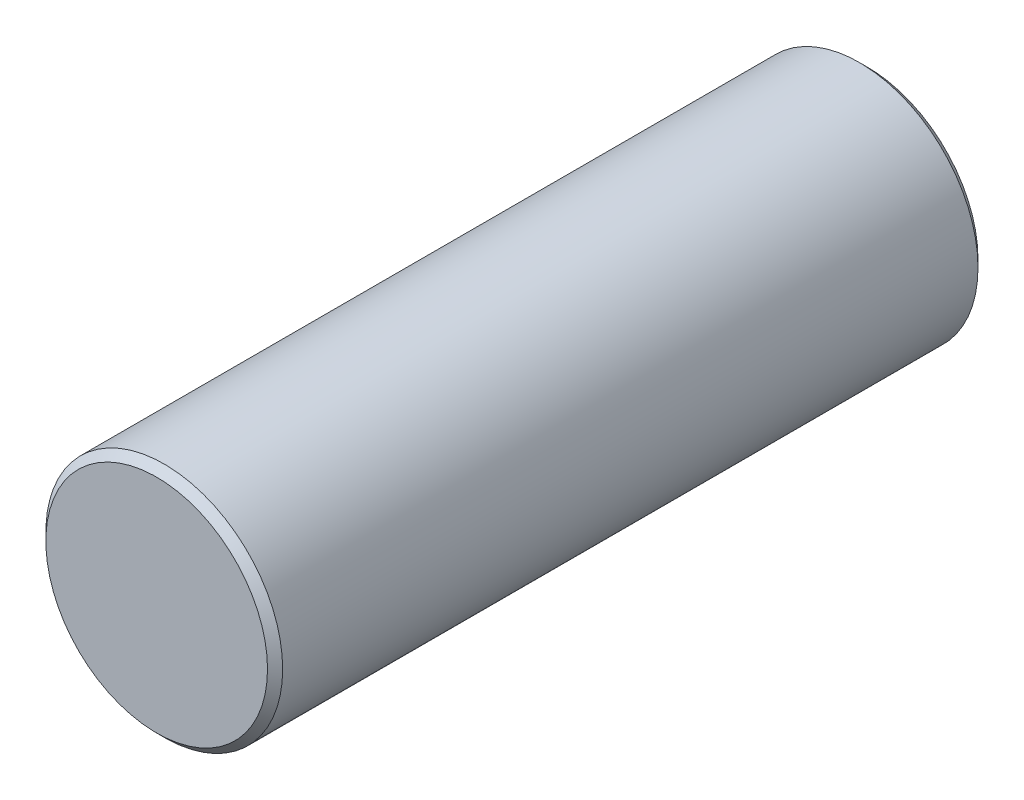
from build123d import *

# Parameters (mm, degrees)
SKETCH1_R         = 6.35
EXTRUDE1_DEPTH    = 19.05
CHAMFER1_SIZE     = 0.4064
SKETCH6_R         = 1.984375
BLIND_HOLES_DEPTH = 6.35


with BuildPart() as part:
    # Sketch1 → Extrude1 (new, symmetric)
    with BuildSketch(Plane.XY):
        with Locations(Location((0, 0, 0), (0, 0, 180))):
            Circle(SKETCH1_R)
    extrude(amount=EXTRUDE1_DEPTH, both=True)

    # Chamfer1
    chamfer1_edges = [part.edges().sort_by_distance(p)[0] for p in [
        (6.35, 0, -19.05),
        (6.35, 0, 19.05),
    ]]
    chamfer(chamfer1_edges, length=CHAMFER1_SIZE)

    # Sketch6 → Blind Holes (cut)
    with BuildSketch(Plane(origin=(0, -6.35, 0), x_dir=(-1, 0, 0), z_dir=(0, 1, 0))):
        with Locations(Location((0, 12.7, 0), (0, 0, 270))):
            Circle(SKETCH6_R)
        with Locations(Location((0, -12.7, 0), (0, 0, 270))):
            Circle(SKETCH6_R)
    extrude(amount=BLIND_HOLES_DEPTH, mode=Mode.SUBTRACT)


solid = part.part
